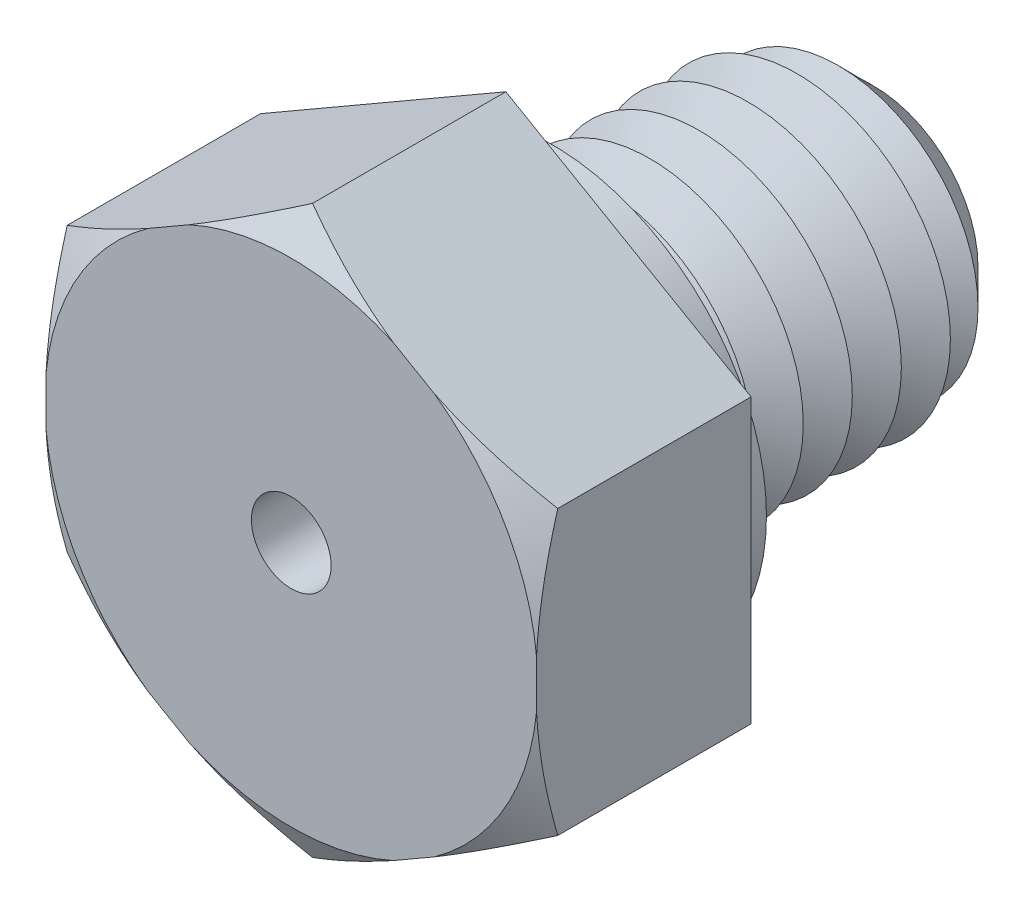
ISO-10303-21;
HEADER;
FILE_DESCRIPTION(('STEP AP214'),'2;1');
FILE_NAME('part.step','',(''),(''),'','','');
FILE_SCHEMA(('AUTOMOTIVE_DESIGN { 1 0 10303 214 1 1 1 1 }'));
ENDSEC;
DATA;
#1=APPLICATION_CONTEXT('core data for automotive mechanical design processes');
#2=APPLICATION_PROTOCOL_DEFINITION('international standard','automotive_design',2000,#1);
#3=PRODUCT_CONTEXT('',#1,'mechanical');
#4=PRODUCT('Part','Part','',(#3));
#5=PRODUCT_RELATED_PRODUCT_CATEGORY('part','',(#4));
#6=PRODUCT_DEFINITION_FORMATION('','',#4);
#7=PRODUCT_DEFINITION_CONTEXT('part definition',#1,'design');
#8=PRODUCT_DEFINITION('design','',#6,#7);
#9=PRODUCT_DEFINITION_SHAPE('','',#8);
#10=(LENGTH_UNIT() NAMED_UNIT(*) SI_UNIT(.MILLI.,.METRE.));
#11=(NAMED_UNIT(*) PLANE_ANGLE_UNIT() SI_UNIT($,.RADIAN.));
#12=(NAMED_UNIT(*) SI_UNIT($,.STERADIAN.) SOLID_ANGLE_UNIT());
#13=UNCERTAINTY_MEASURE_WITH_UNIT(LENGTH_MEASURE(1.E-05),#10,'distance_accuracy_value','');
#14=(GEOMETRIC_REPRESENTATION_CONTEXT(3) GLOBAL_UNCERTAINTY_ASSIGNED_CONTEXT((#13)) GLOBAL_UNIT_ASSIGNED_CONTEXT((#10,
#11,#12)) REPRESENTATION_CONTEXT('',''));
#15=CARTESIAN_POINT('',(0.,0.,0.));
#16=DIRECTION('',(0.,0.,1.));
#17=DIRECTION('',(1.,0.,0.));
#18=AXIS2_PLACEMENT_3D('',#15,#16,#17);
#19=CARTESIAN_POINT('',(4.,2.3094010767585,3.5));
#20=DIRECTION('',(-0.5,-0.866025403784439,0.));
#21=DIRECTION('',(0.866025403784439,-0.5,0.));
#22=AXIS2_PLACEMENT_3D('',#19,#20,#21);
#23=PLANE('',#22);
#24=CARTESIAN_POINT('',(6.77926459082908,0.704791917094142,1.88515125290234));
#25=CARTESIAN_POINT('',(6.65357706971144,0.777357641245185,1.95298106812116));
#26=CARTESIAN_POINT('',(6.52758896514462,0.850096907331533,2.02007962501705));
#27=CARTESIAN_POINT('',(6.2748848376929,0.995995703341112,2.15247084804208));
#28=CARTESIAN_POINT('',(6.14816872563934,1.06915528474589,2.21776328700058));
#29=CARTESIAN_POINT('',(5.8935057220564,1.21618503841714,2.34638757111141));
#30=CARTESIAN_POINT('',(5.76555618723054,1.29005673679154,2.40971246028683));
#31=CARTESIAN_POINT('',(5.50869902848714,1.43835328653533,2.53371033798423));
#32=CARTESIAN_POINT('',(5.37979143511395,1.51277812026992,2.59438341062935));
#33=CARTESIAN_POINT('',(5.11756014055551,1.66417742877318,2.71400439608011));
#34=CARTESIAN_POINT('',(4.98420771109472,1.74116848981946,2.77286873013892));
#35=CARTESIAN_POINT('',(4.7161724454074,1.89591872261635,2.88640197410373));
#36=CARTESIAN_POINT('',(4.58148968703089,1.97367784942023,2.94107112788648));
#37=CARTESIAN_POINT('',(4.31074083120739,2.12999477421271,3.0451841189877));
#38=CARTESIAN_POINT('',(4.17467611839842,2.20855177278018,3.09463271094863));
#39=CARTESIAN_POINT('',(3.90094921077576,2.36658807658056,3.18716064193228));
#40=CARTESIAN_POINT('',(3.76328722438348,2.44606726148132,3.23024080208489));
#41=CARTESIAN_POINT('',(3.43409497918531,2.63612649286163,3.32342391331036));
#42=CARTESIAN_POINT('',(3.24179802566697,2.74714919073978,3.37006382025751));
#43=CARTESIAN_POINT('',(2.95137883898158,2.91482278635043,3.4261412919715));
#44=CARTESIAN_POINT('',(2.85424512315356,2.97090296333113,3.44251989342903));
#45=CARTESIAN_POINT('',(2.65944416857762,3.08337134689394,3.47023794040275));
#46=CARTESIAN_POINT('',(2.56177700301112,3.13975951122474,3.48157806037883));
#47=CARTESIAN_POINT('',(2.36721602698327,3.25208934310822,3.49879538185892));
#48=CARTESIAN_POINT('',(2.27032632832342,3.30802863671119,3.50473421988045));
#49=CARTESIAN_POINT('',(2.07641108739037,3.41998565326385,3.51119583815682));
#50=CARTESIAN_POINT('',(1.97938554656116,3.47600337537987,3.51171867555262));
#51=CARTESIAN_POINT('',(1.78542763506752,3.58798502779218,3.50733170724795));
#52=CARTESIAN_POINT('',(1.68849526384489,3.64394895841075,3.50242193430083));
#53=CARTESIAN_POINT('',(1.49492986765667,3.75570399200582,3.48731840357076));
#54=CARTESIAN_POINT('',(1.39829689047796,3.81149506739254,3.47712384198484));
#55=CARTESIAN_POINT('',(1.17011172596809,3.94323783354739,3.44706969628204));
#56=CARTESIAN_POINT('',(1.03877271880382,4.01906644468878,3.42503535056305));
#57=CARTESIAN_POINT('',(0.777349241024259,4.1699993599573,3.37264454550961));
#58=CARTESIAN_POINT('',(0.647264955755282,4.24510355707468,3.34228687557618));
#59=CARTESIAN_POINT('',(0.388367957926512,4.39457780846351,3.27439527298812));
#60=CARTESIAN_POINT('',(0.259556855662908,4.46894693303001,3.2368532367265));
#61=CARTESIAN_POINT('',(0.00337956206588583,4.61685096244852,3.15577578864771));
#62=CARTESIAN_POINT('',(-0.12398672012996,4.69038591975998,3.11224075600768));
#63=CARTESIAN_POINT('',(-0.378873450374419,4.83754484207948,3.01966290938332));
#64=CARTESIAN_POINT('',(-0.506377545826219,4.91115936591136,2.97056048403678));
#65=CARTESIAN_POINT('',(-0.760034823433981,5.05760846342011,2.86822484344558));
#66=CARTESIAN_POINT('',(-0.886188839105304,5.1304435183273,2.81499436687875));
#67=CARTESIAN_POINT('',(-1.13734672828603,5.27544959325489,2.70513446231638));
#68=CARTESIAN_POINT('',(-1.26235083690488,5.34762074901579,2.6485057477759));
#69=CARTESIAN_POINT('',(-1.51137836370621,5.49139685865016,2.53244390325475));
#70=CARTESIAN_POINT('',(-1.63540176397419,5.56300180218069,2.47301072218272));
#71=CARTESIAN_POINT('',(-1.84520240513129,5.6841302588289,2.37015667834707));
#72=CARTESIAN_POINT('',(-1.93119941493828,5.73378065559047,2.32733101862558));
#73=CARTESIAN_POINT('',(-2.10281451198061,5.83286267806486,2.24068817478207));
#74=CARTESIAN_POINT('',(-2.1884326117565,5.88229431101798,2.19687102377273));
#75=CARTESIAN_POINT('',(-2.35842282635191,5.98043820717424,2.10883190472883));
#76=CARTESIAN_POINT('',(-2.44279852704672,6.02915254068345,2.06461915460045));
#77=CARTESIAN_POINT('',(-2.61124951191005,6.12640776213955,1.97543229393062));
#78=CARTESIAN_POINT('',(-2.69532479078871,6.17494864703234,1.93045817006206));
#79=CARTESIAN_POINT('',(-2.77926459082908,6.22341131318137,1.88515125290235));
#80=B_SPLINE_CURVE_WITH_KNOTS('',3,(#24,#25,#26,#27,#28,#29,#30,#31,#32,#33,#34,#35,#36,#37,#38,
#39,#40,#41,#42,#43,#44,#45,#46,#47,#48,#49,#50,#51,#52,#53,#54,#55,#56,#57,#58,#59,#60,#61,#62,
#63,#64,#65,#66,#67,#68,#69,#70,#71,#72,#73,#74,#75,#76,#77,#78,#79),.UNSPECIFIED.,.F.,.F.,(4,2,
2,2,2,2,2,2,2,2,2,2,2,2,2,2,2,2,2,2,2,2,2,2,2,2,2,4),(0.,0.480604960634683,0.961270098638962,
1.44347608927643,1.92566677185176,2.42016676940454,2.91463799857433,3.4086549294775,
3.90260810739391,4.58254272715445,4.92249867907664,5.26240911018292,5.59839013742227,
5.93436761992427,6.27034307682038,6.60636964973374,7.06584039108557,7.52537799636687,
7.98543702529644,8.44546695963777,8.91099531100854,9.37621741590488,9.84134218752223,
10.3064754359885,10.6308960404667,10.9553058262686,11.2762760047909,11.5972518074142),.UNSPECIFIED.);
#81=CARTESIAN_POINT('',(4.,2.3094010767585,3.15358983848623));
#82=VERTEX_POINT('',#81);
#83=CARTESIAN_POINT('',(2.33627081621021,3.26995556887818,3.5));
#84=VERTEX_POINT('',#83);
#85=EDGE_CURVE('E132',#82,#84,#80,.T.);
#86=ORIENTED_EDGE('',*,*,#85,.F.);
#87=DIRECTION('',(0.,0.,-1.));
#88=VECTOR('',#87,1.);
#89=CARTESIAN_POINT('',(4.,2.3094010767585,3.5));
#90=LINE('',#89,#88);
#91=CARTESIAN_POINT('',(4.,2.3094010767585,0.));
#92=VERTEX_POINT('',#91);
#93=EDGE_CURVE('E144',#82,#92,#90,.T.);
#94=ORIENTED_EDGE('',*,*,#93,.T.);
#95=DIRECTION('',(-0.866025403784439,0.5,0.));
#96=VECTOR('',#95,1.);
#97=CARTESIAN_POINT('',(4.,2.3094010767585,0.));
#98=LINE('',#97,#96);
#99=CARTESIAN_POINT('',(0.,4.61880215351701,0.));
#100=VERTEX_POINT('',#99);
#101=EDGE_CURVE('E248',#92,#100,#98,.T.);
#102=ORIENTED_EDGE('',*,*,#101,.T.);
#103=DIRECTION('',(0.,0.,-1.));
#104=VECTOR('',#103,1.);
#105=CARTESIAN_POINT('',(0.,4.61880215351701,3.5));
#106=LINE('',#105,#104);
#107=CARTESIAN_POINT('',(0.,4.61880215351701,3.15358983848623));
#108=VERTEX_POINT('',#107);
#109=EDGE_CURVE('E178',#108,#100,#106,.T.);
#110=ORIENTED_EDGE('',*,*,#109,.F.);
#111=CARTESIAN_POINT('',(1.66372918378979,3.65824766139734,3.5));
#112=VERTEX_POINT('',#111);
#113=EDGE_CURVE('E151',#112,#108,#80,.T.);
#114=ORIENTED_EDGE('',*,*,#113,.F.);
#115=DIRECTION('',(-0.866025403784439,0.5,0.));
#116=VECTOR('',#115,1.);
#117=CARTESIAN_POINT('',(4.,2.3094010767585,3.5));
#118=LINE('',#117,#116);
#119=EDGE_CURVE('E148',#84,#112,#118,.T.);
#120=ORIENTED_EDGE('',*,*,#119,.F.);
#121=EDGE_LOOP('',(#86,#94,#102,#110,#114,#120));
#122=FACE_BOUND('',#121,.T.);
#123=ADVANCED_FACE('F39',(#122),#23,.F.);
#124=CARTESIAN_POINT('',(0.,4.61880215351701,3.5));
#125=DIRECTION('',(0.5,-0.866025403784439,0.));
#126=DIRECTION('',(0.866025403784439,0.5,0.));
#127=AXIS2_PLACEMENT_3D('',#124,#125,#126);
#128=PLANE('',#127);
#129=CARTESIAN_POINT('',(2.77926459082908,6.22341131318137,1.88515125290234));
#130=CARTESIAN_POINT('',(2.65357706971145,6.15084558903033,1.95298106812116));
#131=CARTESIAN_POINT('',(2.52758896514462,6.07810632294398,2.02007962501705));
#132=CARTESIAN_POINT('',(2.2748848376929,5.9322075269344,2.15247084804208));
#133=CARTESIAN_POINT('',(2.14816872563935,5.85904794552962,2.21776328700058));
#134=CARTESIAN_POINT('',(1.89350572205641,5.71201819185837,2.34638757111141));
#135=CARTESIAN_POINT('',(1.76555618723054,5.63814649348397,2.40971246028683));
#136=CARTESIAN_POINT('',(1.50869902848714,5.48984994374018,2.53371033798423));
#137=CARTESIAN_POINT('',(1.37979143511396,5.41542511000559,2.59438341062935));
#138=CARTESIAN_POINT('',(1.11756014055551,5.26402580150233,2.71400439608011));
#139=CARTESIAN_POINT('',(0.984207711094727,5.18703474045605,2.77286873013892));
#140=CARTESIAN_POINT('',(0.716172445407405,5.03228450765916,2.88640197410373));
#141=CARTESIAN_POINT('',(0.581489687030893,4.95452538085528,2.94107112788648));
#142=CARTESIAN_POINT('',(0.310740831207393,4.7982084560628,3.0451841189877));
#143=CARTESIAN_POINT('',(0.174676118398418,4.71965145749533,3.09463271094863));
#144=CARTESIAN_POINT('',(-0.0990507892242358,4.56161515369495,3.18716064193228));
#145=CARTESIAN_POINT('',(-0.236712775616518,4.48213596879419,3.23024080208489));
#146=CARTESIAN_POINT('',(-0.565905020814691,4.29207673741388,3.32342391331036));
#147=CARTESIAN_POINT('',(-0.758201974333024,4.18105403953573,3.37006382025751));
#148=CARTESIAN_POINT('',(-1.04862116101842,4.01338044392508,3.4261412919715));
#149=CARTESIAN_POINT('',(-1.14575487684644,3.95730026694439,3.44251989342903));
#150=CARTESIAN_POINT('',(-1.34055583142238,3.84483188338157,3.47023794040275));
#151=CARTESIAN_POINT('',(-1.43822299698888,3.78844371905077,3.48157806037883));
#152=CARTESIAN_POINT('',(-1.63278397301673,3.67611388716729,3.49879538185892));
#153=CARTESIAN_POINT('',(-1.72967367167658,3.62017459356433,3.50473421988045));
#154=CARTESIAN_POINT('',(-1.92358891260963,3.50821757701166,3.51119583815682));
#155=CARTESIAN_POINT('',(-2.02061445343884,3.45219985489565,3.51171867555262));
#156=CARTESIAN_POINT('',(-2.21457236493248,3.34021820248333,3.50733170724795));
#157=CARTESIAN_POINT('',(-2.31150473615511,3.28425427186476,3.50242193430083));
#158=CARTESIAN_POINT('',(-2.50507013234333,3.17249923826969,3.48731840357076));
#159=CARTESIAN_POINT('',(-2.60170310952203,3.11670816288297,3.47712384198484));
#160=CARTESIAN_POINT('',(-2.8298882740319,2.98496539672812,3.44706969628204));
#161=CARTESIAN_POINT('',(-2.96122728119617,2.90913678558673,3.42503535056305));
#162=CARTESIAN_POINT('',(-3.22265075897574,2.75820387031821,3.37264454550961));
#163=CARTESIAN_POINT('',(-3.35273504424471,2.68309967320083,3.34228687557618));
#164=CARTESIAN_POINT('',(-3.61163204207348,2.533625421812,3.27439527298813));
#165=CARTESIAN_POINT('',(-3.74044314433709,2.4592562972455,3.2368532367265));
#166=CARTESIAN_POINT('',(-3.99662043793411,2.31135226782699,3.15577578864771));
#167=CARTESIAN_POINT('',(-4.12398672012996,2.23781731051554,3.11224075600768));
#168=CARTESIAN_POINT('',(-4.37887345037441,2.09065838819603,3.01966290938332));
#169=CARTESIAN_POINT('',(-4.50637754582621,2.01704386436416,2.97056048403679));
#170=CARTESIAN_POINT('',(-4.76003482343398,1.87059476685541,2.86822484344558));
#171=CARTESIAN_POINT('',(-4.8861888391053,1.79775971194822,2.81499436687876));
#172=CARTESIAN_POINT('',(-5.13734672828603,1.65275363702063,2.70513446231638));
#173=CARTESIAN_POINT('',(-5.26235083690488,1.58058248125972,2.6485057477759));
#174=CARTESIAN_POINT('',(-5.51137836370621,1.43680637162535,2.53244390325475));
#175=CARTESIAN_POINT('',(-5.63540176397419,1.36520142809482,2.47301072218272));
#176=CARTESIAN_POINT('',(-5.84520240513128,1.24407297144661,2.37015667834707));
#177=CARTESIAN_POINT('',(-5.93119941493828,1.19442257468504,2.32733101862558));
#178=CARTESIAN_POINT('',(-6.10281451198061,1.09534055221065,2.24068817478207));
#179=CARTESIAN_POINT('',(-6.1884326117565,1.04590891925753,2.19687102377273));
#180=CARTESIAN_POINT('',(-6.35842282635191,0.947765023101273,2.10883190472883));
#181=CARTESIAN_POINT('',(-6.44279852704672,0.899050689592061,2.06461915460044));
#182=CARTESIAN_POINT('',(-6.61124951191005,0.80179546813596,1.97543229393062));
#183=CARTESIAN_POINT('',(-6.69532479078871,0.753254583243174,1.93045817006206));
#184=CARTESIAN_POINT('',(-6.77926459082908,0.70479191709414,1.88515125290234));
#185=B_SPLINE_CURVE_WITH_KNOTS('',3,(#129,#130,#131,#132,#133,#134,#135,#136,#137,#138,#139,
#140,#141,#142,#143,#144,#145,#146,#147,#148,#149,#150,#151,#152,#153,#154,#155,#156,#157,#158,
#159,#160,#161,#162,#163,#164,#165,#166,#167,#168,#169,#170,#171,#172,#173,#174,#175,#176,#177,
#178,#179,#180,#181,#182,#183,#184),.UNSPECIFIED.,.F.,.F.,(4,2,2,2,2,2,2,2,2,2,2,2,2,2,2,2,2,2,
2,2,2,2,2,2,2,2,2,4),(0.,0.480604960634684,0.961270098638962,1.44347608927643,1.92566677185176,
2.42016676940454,2.91463799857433,3.4086549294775,3.90260810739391,4.58254272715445,
4.92249867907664,5.26240911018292,5.59839013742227,5.93436761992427,6.27034307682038,
6.60636964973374,7.06584039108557,7.52537799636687,7.98543702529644,8.44546695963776,
8.91099531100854,9.37621741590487,9.84134218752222,10.3064754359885,10.6308960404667,
10.9553058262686,11.2762760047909,11.5972518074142),.UNSPECIFIED.);
#186=CARTESIAN_POINT('',(-1.66372918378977,3.65824766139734,3.5));
#187=VERTEX_POINT('',#186);
#188=EDGE_CURVE('E289',#108,#187,#185,.T.);
#189=ORIENTED_EDGE('',*,*,#188,.F.);
#190=ORIENTED_EDGE('',*,*,#109,.T.);
#191=DIRECTION('',(-0.866025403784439,-0.5,0.));
#192=VECTOR('',#191,1.);
#193=CARTESIAN_POINT('',(0.,4.61880215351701,0.));
#194=LINE('',#193,#192);
#195=CARTESIAN_POINT('',(-4.,2.3094010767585,0.));
#196=VERTEX_POINT('',#195);
#197=EDGE_CURVE('E268',#100,#196,#194,.T.);
#198=ORIENTED_EDGE('',*,*,#197,.T.);
#199=DIRECTION('',(0.,0.,-1.));
#200=VECTOR('',#199,1.);
#201=CARTESIAN_POINT('',(-4.,2.3094010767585,3.5));
#202=LINE('',#201,#200);
#203=CARTESIAN_POINT('',(-4.,2.3094010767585,3.15358983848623));
#204=VERTEX_POINT('',#203);
#205=EDGE_CURVE('E175',#204,#196,#202,.T.);
#206=ORIENTED_EDGE('',*,*,#205,.F.);
#207=CARTESIAN_POINT('',(-2.33627081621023,3.26995556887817,3.5));
#208=VERTEX_POINT('',#207);
#209=EDGE_CURVE('E291',#208,#204,#185,.T.);
#210=ORIENTED_EDGE('',*,*,#209,.F.);
#211=DIRECTION('',(-0.866025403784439,-0.5,0.));
#212=VECTOR('',#211,1.);
#213=CARTESIAN_POINT('',(0.,4.61880215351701,3.5));
#214=LINE('',#213,#212);
#215=EDGE_CURVE('E251',#187,#208,#214,.T.);
#216=ORIENTED_EDGE('',*,*,#215,.F.);
#217=EDGE_LOOP('',(#189,#190,#198,#206,#210,#216));
#218=FACE_BOUND('',#217,.T.);
#219=ADVANCED_FACE('F359',(#218),#128,.F.);
#220=CARTESIAN_POINT('',(-4.,2.3094010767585,3.5));
#221=DIRECTION('',(1.,0.,0.));
#222=DIRECTION('',(0.,0.,-1.));
#223=AXIS2_PLACEMENT_3D('',#220,#221,#222);
#224=PLANE('',#223);
#225=CARTESIAN_POINT('',(-4.,5.08866566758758,2.08330060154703));
#226=CARTESIAN_POINT('',(-4.,4.94414615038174,2.14888120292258));
#227=CARTESIAN_POINT('',(-4.,4.79923170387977,2.21360759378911));
#228=CARTESIAN_POINT('',(-4.,4.5084433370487,2.34093771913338));
#229=CARTESIAN_POINT('',(-4.,4.36256924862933,2.4035410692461));
#230=CARTESIAN_POINT('',(-4.,4.06913305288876,2.52644280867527));
#231=CARTESIAN_POINT('',(-4.,3.92156644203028,2.58673049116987));
#232=CARTESIAN_POINT('',(-4.,3.62518774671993,2.70415001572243));
#233=CARTESIAN_POINT('',(-4.,3.47637571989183,2.76128200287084));
#234=CARTESIAN_POINT('',(-4.,3.17798204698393,2.87144502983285));
#235=CARTESIAN_POINT('',(-4.,3.02840679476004,2.92449322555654));
#236=CARTESIAN_POINT('',(-4.,2.72767549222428,3.02589725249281));
#237=CARTESIAN_POINT('',(-4.,2.57651933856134,3.07425277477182));
#238=CARTESIAN_POINT('',(-4.,2.12084922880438,3.21062944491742));
#239=CARTESIAN_POINT('',(-4.,1.81364350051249,3.29014850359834));
#240=CARTESIAN_POINT('',(-4.,1.28033133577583,3.39840613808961));
#241=CARTESIAN_POINT('',(-4.,1.05588972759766,3.43514774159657));
#242=CARTESIAN_POINT('',(-4.,0.717455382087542,3.47487260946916));
#243=CARTESIAN_POINT('',(-4.,0.604348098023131,3.48554965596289));
#244=CARTESIAN_POINT('',(-4.,0.377758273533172,3.50148677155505));
#245=CARTESIAN_POINT('',(-4.,0.264275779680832,3.50674748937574));
#246=CARTESIAN_POINT('',(-4.,0.0372413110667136,3.51168400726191));
#247=CARTESIAN_POINT('',(-4.,-0.0763106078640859,3.51136237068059));
#248=CARTESIAN_POINT('',(-4.,-0.303259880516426,3.50515259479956));
#249=CARTESIAN_POINT('',(-4.,-0.416657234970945,3.49926448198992));
#250=CARTESIAN_POINT('',(-4.,-0.643045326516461,3.48210091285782));
#251=CARTESIAN_POINT('',(-4.,-0.756036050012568,3.47082527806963));
#252=CARTESIAN_POINT('',(-4.,-0.9814050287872,3.44321260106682));
#253=CARTESIAN_POINT('',(-4.,-1.09378317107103,3.42687465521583));
#254=CARTESIAN_POINT('',(-4.,-1.54188975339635,3.35219605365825));
#255=CARTESIAN_POINT('',(-4.,-1.87460189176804,3.27522286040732));
#256=CARTESIAN_POINT('',(-4.,-2.36751874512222,3.1379521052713));
#257=CARTESIAN_POINT('',(-4.,-2.53101356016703,3.08847923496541));
#258=CARTESIAN_POINT('',(-4.,-2.85611626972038,2.98363580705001));
#259=CARTESIAN_POINT('',(-4.,-3.01772429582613,2.92826566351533));
#260=CARTESIAN_POINT('',(-4.,-3.34106601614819,2.81212836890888));
#261=CARTESIAN_POINT('',(-4.,-3.50277978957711,2.75130648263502));
#262=CARTESIAN_POINT('',(-4.,-3.82469686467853,2.62576992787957));
#263=CARTESIAN_POINT('',(-4.,-3.98490007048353,2.56105501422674));
#264=CARTESIAN_POINT('',(-4.,-4.30300593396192,2.42890950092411));
#265=CARTESIAN_POINT('',(-4.,-4.46091670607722,2.36149833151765));
#266=CARTESIAN_POINT('',(-4.,-4.7755935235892,2.22415533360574));
#267=CARTESIAN_POINT('',(-4.,-4.93235984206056,2.15422413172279));
#268=CARTESIAN_POINT('',(-4.,-5.08866566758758,2.08330060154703));
#269=B_SPLINE_CURVE_WITH_KNOTS('',3,(#225,#226,#227,#228,#229,#230,#231,#232,#233,#234,#235,
#236,#237,#238,#239,#240,#241,#242,#243,#244,#245,#246,#247,#248,#249,#250,#251,#252,#253,#254,
#255,#256,#257,#258,#259,#260,#261,#262,#263,#264,#265,#266,#267,#268),.UNSPECIFIED.,.F.,.F.,(4,
2,2,2,2,2,2,2,2,2,2,2,2,2,2,2,2,2,2,2,2,4),(0.,0.476116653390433,0.952319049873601,
1.43050831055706,1.90867556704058,2.38470991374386,2.8607755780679,3.81133518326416,
4.4927622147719,4.83347879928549,5.17415457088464,5.51467391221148,5.85519163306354,
6.19572063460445,6.53631045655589,7.55838749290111,8.07079781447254,8.58317218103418,
9.1014378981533,9.61973628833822,10.1348057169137,10.6497479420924),.UNSPECIFIED.);
#270=CARTESIAN_POINT('',(-4.,0.388292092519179,3.5));
#271=VERTEX_POINT('',#270);
#272=EDGE_CURVE('E349',#204,#271,#269,.T.);
#273=ORIENTED_EDGE('',*,*,#272,.F.);
#274=ORIENTED_EDGE('',*,*,#205,.T.);
#275=DIRECTION('',(0.,-1.,0.));
#276=VECTOR('',#275,1.);
#277=CARTESIAN_POINT('',(-4.,2.3094010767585,0.));
#278=LINE('',#277,#276);
#279=CARTESIAN_POINT('',(-4.,-2.3094010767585,0.));
#280=VERTEX_POINT('',#279);
#281=EDGE_CURVE('E272',#196,#280,#278,.T.);
#282=ORIENTED_EDGE('',*,*,#281,.T.);
#283=DIRECTION('',(0.,0.,-1.));
#284=VECTOR('',#283,1.);
#285=CARTESIAN_POINT('',(-4.,-2.3094010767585,3.5));
#286=LINE('',#285,#284);
#287=CARTESIAN_POINT('',(-4.,-2.3094010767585,3.15358983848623));
#288=VERTEX_POINT('',#287);
#289=EDGE_CURVE('E172',#288,#280,#286,.T.);
#290=ORIENTED_EDGE('',*,*,#289,.F.);
#291=CARTESIAN_POINT('',(-4.,-0.38829209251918,3.5));
#292=VERTEX_POINT('',#291);
#293=EDGE_CURVE('E343',#292,#288,#269,.T.);
#294=ORIENTED_EDGE('',*,*,#293,.F.);
#295=DIRECTION('',(0.,-1.,0.));
#296=VECTOR('',#295,1.);
#297=CARTESIAN_POINT('',(-4.,2.3094010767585,3.5));
#298=LINE('',#297,#296);
#299=EDGE_CURVE('E255',#271,#292,#298,.T.);
#300=ORIENTED_EDGE('',*,*,#299,.F.);
#301=EDGE_LOOP('',(#273,#274,#282,#290,#294,#300));
#302=FACE_BOUND('',#301,.T.);
#303=ADVANCED_FACE('F355',(#302),#224,.F.);
#304=CARTESIAN_POINT('',(-4.,-2.3094010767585,3.5));
#305=DIRECTION('',(0.5,0.866025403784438,0.));
#306=DIRECTION('',(-0.866025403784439,0.5,0.));
#307=AXIS2_PLACEMENT_3D('',#304,#305,#306);
#308=PLANE('',#307);
#309=CARTESIAN_POINT('',(-6.77926459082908,-0.704791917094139,1.88515125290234));
#310=CARTESIAN_POINT('',(-6.65357706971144,-0.777357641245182,1.95298106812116));
#311=CARTESIAN_POINT('',(-6.52758896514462,-0.85009690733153,2.02007962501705));
#312=CARTESIAN_POINT('',(-6.2748848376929,-0.995995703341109,2.15247084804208));
#313=CARTESIAN_POINT('',(-6.14816872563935,-1.06915528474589,2.21776328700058));
#314=CARTESIAN_POINT('',(-5.89350572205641,-1.21618503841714,2.34638757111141));
#315=CARTESIAN_POINT('',(-5.76555618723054,-1.29005673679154,2.40971246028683));
#316=CARTESIAN_POINT('',(-5.50869902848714,-1.43835328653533,2.53371033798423));
#317=CARTESIAN_POINT('',(-5.37979143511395,-1.51277812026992,2.59438341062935));
#318=CARTESIAN_POINT('',(-5.11756014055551,-1.66417742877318,2.71400439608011));
#319=CARTESIAN_POINT('',(-4.98420771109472,-1.74116848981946,2.77286873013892));
#320=CARTESIAN_POINT('',(-4.7161724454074,-1.89591872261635,2.88640197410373));
#321=CARTESIAN_POINT('',(-4.58148968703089,-1.97367784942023,2.94107112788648));
#322=CARTESIAN_POINT('',(-4.31074083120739,-2.12999477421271,3.0451841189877));
#323=CARTESIAN_POINT('',(-4.17467611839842,-2.20855177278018,3.09463271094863));
#324=CARTESIAN_POINT('',(-3.90094921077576,-2.36658807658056,3.18716064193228));
#325=CARTESIAN_POINT('',(-3.76328722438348,-2.44606726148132,3.23024080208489));
#326=CARTESIAN_POINT('',(-3.43409497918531,-2.63612649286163,3.32342391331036));
#327=CARTESIAN_POINT('',(-3.24179802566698,-2.74714919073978,3.37006382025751));
#328=CARTESIAN_POINT('',(-2.95137883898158,-2.91482278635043,3.4261412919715));
#329=CARTESIAN_POINT('',(-2.85424512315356,-2.97090296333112,3.44251989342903));
#330=CARTESIAN_POINT('',(-2.65944416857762,-3.08337134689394,3.47023794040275));
#331=CARTESIAN_POINT('',(-2.56177700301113,-3.13975951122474,3.48157806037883));
#332=CARTESIAN_POINT('',(-2.36721602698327,-3.25208934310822,3.49879538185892));
#333=CARTESIAN_POINT('',(-2.27032632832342,-3.30802863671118,3.50473421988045));
#334=CARTESIAN_POINT('',(-2.07641108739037,-3.41998565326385,3.51119583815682));
#335=CARTESIAN_POINT('',(-1.97938554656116,-3.47600337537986,3.51171867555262));
#336=CARTESIAN_POINT('',(-1.78542763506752,-3.58798502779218,3.50733170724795));
#337=CARTESIAN_POINT('',(-1.68849526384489,-3.64394895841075,3.50242193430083));
#338=CARTESIAN_POINT('',(-1.49492986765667,-3.75570399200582,3.48731840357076));
#339=CARTESIAN_POINT('',(-1.39829689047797,-3.81149506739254,3.47712384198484));
#340=CARTESIAN_POINT('',(-1.1701117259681,-3.94323783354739,3.44706969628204));
#341=CARTESIAN_POINT('',(-1.03877271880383,-4.01906644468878,3.42503535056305));
#342=CARTESIAN_POINT('',(-0.777349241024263,-4.1699993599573,3.37264454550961));
#343=CARTESIAN_POINT('',(-0.647264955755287,-4.24510355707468,3.34228687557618));
#344=CARTESIAN_POINT('',(-0.388367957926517,-4.39457780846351,3.27439527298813));
#345=CARTESIAN_POINT('',(-0.259556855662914,-4.46894693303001,3.2368532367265));
#346=CARTESIAN_POINT('',(-0.00337956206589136,-4.61685096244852,3.15577578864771));
#347=CARTESIAN_POINT('',(0.123986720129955,-4.69038591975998,3.11224075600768));
#348=CARTESIAN_POINT('',(0.378873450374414,-4.83754484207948,3.01966290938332));
#349=CARTESIAN_POINT('',(0.506377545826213,-4.91115936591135,2.97056048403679));
#350=CARTESIAN_POINT('',(0.760034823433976,-5.0576084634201,2.86822484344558));
#351=CARTESIAN_POINT('',(0.886188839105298,-5.13044351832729,2.81499436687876));
#352=CARTESIAN_POINT('',(1.13734672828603,-5.27544959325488,2.70513446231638));
#353=CARTESIAN_POINT('',(1.26235083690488,-5.34762074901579,2.6485057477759));
#354=CARTESIAN_POINT('',(1.51137836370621,-5.49139685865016,2.53244390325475));
#355=CARTESIAN_POINT('',(1.63540176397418,-5.56300180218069,2.47301072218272));
#356=CARTESIAN_POINT('',(1.84520240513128,-5.6841302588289,2.37015667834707));
#357=CARTESIAN_POINT('',(1.93119941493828,-5.73378065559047,2.32733101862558));
#358=CARTESIAN_POINT('',(2.10281451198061,-5.83286267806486,2.24068817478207));
#359=CARTESIAN_POINT('',(2.1884326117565,-5.88229431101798,2.19687102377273));
#360=CARTESIAN_POINT('',(2.35842282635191,-5.98043820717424,2.10883190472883));
#361=CARTESIAN_POINT('',(2.44279852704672,-6.02915254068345,2.06461915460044));
#362=CARTESIAN_POINT('',(2.61124951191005,-6.12640776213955,1.97543229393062));
#363=CARTESIAN_POINT('',(2.6953247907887,-6.17494864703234,1.93045817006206));
#364=CARTESIAN_POINT('',(2.77926459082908,-6.22341131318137,1.88515125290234));
#365=B_SPLINE_CURVE_WITH_KNOTS('',3,(#309,#310,#311,#312,#313,#314,#315,#316,#317,#318,#319,
#320,#321,#322,#323,#324,#325,#326,#327,#328,#329,#330,#331,#332,#333,#334,#335,#336,#337,#338,
#339,#340,#341,#342,#343,#344,#345,#346,#347,#348,#349,#350,#351,#352,#353,#354,#355,#356,#357,
#358,#359,#360,#361,#362,#363,#364),.UNSPECIFIED.,.F.,.F.,(4,2,2,2,2,2,2,2,2,2,2,2,2,2,2,2,2,2,
2,2,2,2,2,2,2,2,2,4),(0.,0.480604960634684,0.961270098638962,1.44347608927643,1.92566677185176,
2.42016676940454,2.91463799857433,3.4086549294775,3.90260810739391,4.58254272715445,
4.92249867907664,5.26240911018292,5.59839013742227,5.93436761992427,6.27034307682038,
6.60636964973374,7.06584039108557,7.52537799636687,7.98543702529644,8.44546695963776,
8.91099531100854,9.37621741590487,9.84134218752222,10.3064754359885,10.6308960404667,
10.9553058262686,11.2762760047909,11.5972518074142),.UNSPECIFIED.);
#366=CARTESIAN_POINT('',(-2.33627081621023,-3.26995556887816,3.5));
#367=VERTEX_POINT('',#366);
#368=EDGE_CURVE('E350',#288,#367,#365,.T.);
#369=ORIENTED_EDGE('',*,*,#368,.F.);
#370=ORIENTED_EDGE('',*,*,#289,.T.);
#371=DIRECTION('',(0.866025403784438,-0.5,0.));
#372=VECTOR('',#371,1.);
#373=CARTESIAN_POINT('',(-4.,-2.3094010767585,0.));
#374=LINE('',#373,#372);
#375=CARTESIAN_POINT('',(0.,-4.61880215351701,0.));
#376=VERTEX_POINT('',#375);
#377=EDGE_CURVE('E276',#280,#376,#374,.T.);
#378=ORIENTED_EDGE('',*,*,#377,.T.);
#379=DIRECTION('',(0.,0.,-1.));
#380=VECTOR('',#379,1.);
#381=CARTESIAN_POINT('',(0.,-4.61880215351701,3.5));
#382=LINE('',#381,#380);
#383=CARTESIAN_POINT('',(0.,-4.61880215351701,3.15358983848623));
#384=VERTEX_POINT('',#383);
#385=EDGE_CURVE('E163',#384,#376,#382,.T.);
#386=ORIENTED_EDGE('',*,*,#385,.F.);
#387=CARTESIAN_POINT('',(-1.66372918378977,-3.65824766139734,3.5));
#388=VERTEX_POINT('',#387);
#389=EDGE_CURVE('E337',#388,#384,#365,.T.);
#390=ORIENTED_EDGE('',*,*,#389,.F.);
#391=DIRECTION('',(0.866025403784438,-0.5,0.));
#392=VECTOR('',#391,1.);
#393=CARTESIAN_POINT('',(-4.,-2.3094010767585,3.5));
#394=LINE('',#393,#392);
#395=EDGE_CURVE('E259',#367,#388,#394,.T.);
#396=ORIENTED_EDGE('',*,*,#395,.F.);
#397=EDGE_LOOP('',(#369,#370,#378,#386,#390,#396));
#398=FACE_BOUND('',#397,.T.);
#399=ADVANCED_FACE('F358',(#398),#308,.F.);
#400=CARTESIAN_POINT('',(0.,-4.61880215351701,3.5));
#401=DIRECTION('',(-0.5,0.866025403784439,0.));
#402=DIRECTION('',(-0.866025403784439,-0.5,0.));
#403=AXIS2_PLACEMENT_3D('',#400,#401,#402);
#404=PLANE('',#403);
#405=CARTESIAN_POINT('',(-2.77926459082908,-6.22341131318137,1.88515125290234));
#406=CARTESIAN_POINT('',(-2.65357706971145,-6.15084558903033,1.95298106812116));
#407=CARTESIAN_POINT('',(-2.52758896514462,-6.07810632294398,2.02007962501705));
#408=CARTESIAN_POINT('',(-2.2748848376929,-5.9322075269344,2.15247084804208));
#409=CARTESIAN_POINT('',(-2.14816872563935,-5.85904794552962,2.21776328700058));
#410=CARTESIAN_POINT('',(-1.89350572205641,-5.71201819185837,2.34638757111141));
#411=CARTESIAN_POINT('',(-1.76555618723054,-5.63814649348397,2.40971246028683));
#412=CARTESIAN_POINT('',(-1.50869902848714,-5.48984994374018,2.53371033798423));
#413=CARTESIAN_POINT('',(-1.37979143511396,-5.41542511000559,2.59438341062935));
#414=CARTESIAN_POINT('',(-1.11756014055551,-5.26402580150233,2.71400439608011));
#415=CARTESIAN_POINT('',(-0.984207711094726,-5.18703474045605,2.77286873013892));
#416=CARTESIAN_POINT('',(-0.716172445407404,-5.03228450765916,2.88640197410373));
#417=CARTESIAN_POINT('',(-0.581489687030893,-4.95452538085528,2.94107112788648));
#418=CARTESIAN_POINT('',(-0.310740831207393,-4.7982084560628,3.0451841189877));
#419=CARTESIAN_POINT('',(-0.174676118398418,-4.71965145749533,3.09463271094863));
#420=CARTESIAN_POINT('',(0.0990507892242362,-4.56161515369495,3.18716064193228));
#421=CARTESIAN_POINT('',(0.236712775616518,-4.48213596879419,3.23024080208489));
#422=CARTESIAN_POINT('',(0.565905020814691,-4.29207673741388,3.32342391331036));
#423=CARTESIAN_POINT('',(0.758201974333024,-4.18105403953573,3.37006382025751));
#424=CARTESIAN_POINT('',(1.04862116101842,-4.01338044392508,3.4261412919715));
#425=CARTESIAN_POINT('',(1.14575487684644,-3.95730026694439,3.44251989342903));
#426=CARTESIAN_POINT('',(1.34055583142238,-3.84483188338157,3.47023794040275));
#427=CARTESIAN_POINT('',(1.43822299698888,-3.78844371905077,3.48157806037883));
#428=CARTESIAN_POINT('',(1.63278397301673,-3.67611388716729,3.49879538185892));
#429=CARTESIAN_POINT('',(1.72967367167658,-3.62017459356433,3.50473421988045));
#430=CARTESIAN_POINT('',(1.92358891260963,-3.50821757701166,3.51119583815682));
#431=CARTESIAN_POINT('',(2.02061445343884,-3.45219985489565,3.51171867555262));
#432=CARTESIAN_POINT('',(2.21457236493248,-3.34021820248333,3.50733170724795));
#433=CARTESIAN_POINT('',(2.31150473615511,-3.28425427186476,3.50242193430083));
#434=CARTESIAN_POINT('',(2.50507013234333,-3.17249923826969,3.48731840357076));
#435=CARTESIAN_POINT('',(2.60170310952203,-3.11670816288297,3.47712384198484));
#436=CARTESIAN_POINT('',(2.8298882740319,-2.98496539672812,3.44706969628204));
#437=CARTESIAN_POINT('',(2.96122728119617,-2.90913678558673,3.42503535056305));
#438=CARTESIAN_POINT('',(3.22265075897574,-2.75820387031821,3.37264454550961));
#439=CARTESIAN_POINT('',(3.35273504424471,-2.68309967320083,3.34228687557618));
#440=CARTESIAN_POINT('',(3.61163204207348,-2.533625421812,3.27439527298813));
#441=CARTESIAN_POINT('',(3.74044314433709,-2.4592562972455,3.2368532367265));
#442=CARTESIAN_POINT('',(3.99662043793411,-2.31135226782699,3.15577578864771));
#443=CARTESIAN_POINT('',(4.12398672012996,-2.23781731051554,3.11224075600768));
#444=CARTESIAN_POINT('',(4.37887345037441,-2.09065838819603,3.01966290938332));
#445=CARTESIAN_POINT('',(4.50637754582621,-2.01704386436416,2.97056048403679));
#446=CARTESIAN_POINT('',(4.76003482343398,-1.87059476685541,2.86822484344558));
#447=CARTESIAN_POINT('',(4.8861888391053,-1.79775971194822,2.81499436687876));
#448=CARTESIAN_POINT('',(5.13734672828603,-1.65275363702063,2.70513446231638));
#449=CARTESIAN_POINT('',(5.26235083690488,-1.58058248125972,2.6485057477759));
#450=CARTESIAN_POINT('',(5.51137836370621,-1.43680637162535,2.53244390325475));
#451=CARTESIAN_POINT('',(5.63540176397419,-1.36520142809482,2.47301072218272));
#452=CARTESIAN_POINT('',(5.84520240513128,-1.24407297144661,2.37015667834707));
#453=CARTESIAN_POINT('',(5.93119941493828,-1.19442257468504,2.32733101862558));
#454=CARTESIAN_POINT('',(6.10281451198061,-1.09534055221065,2.24068817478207));
#455=CARTESIAN_POINT('',(6.1884326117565,-1.04590891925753,2.19687102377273));
#456=CARTESIAN_POINT('',(6.35842282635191,-0.947765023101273,2.10883190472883));
#457=CARTESIAN_POINT('',(6.44279852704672,-0.899050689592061,2.06461915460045));
#458=CARTESIAN_POINT('',(6.61124951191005,-0.80179546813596,1.97543229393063));
#459=CARTESIAN_POINT('',(6.69532479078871,-0.753254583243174,1.93045817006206));
#460=CARTESIAN_POINT('',(6.77926459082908,-0.70479191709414,1.88515125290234));
#461=B_SPLINE_CURVE_WITH_KNOTS('',3,(#405,#406,#407,#408,#409,#410,#411,#412,#413,#414,#415,
#416,#417,#418,#419,#420,#421,#422,#423,#424,#425,#426,#427,#428,#429,#430,#431,#432,#433,#434,
#435,#436,#437,#438,#439,#440,#441,#442,#443,#444,#445,#446,#447,#448,#449,#450,#451,#452,#453,
#454,#455,#456,#457,#458,#459,#460),.UNSPECIFIED.,.F.,.F.,(4,2,2,2,2,2,2,2,2,2,2,2,2,2,2,2,2,2,
2,2,2,2,2,2,2,2,2,4),(0.,0.480604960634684,0.961270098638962,1.44347608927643,1.92566677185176,
2.42016676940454,2.91463799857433,3.4086549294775,3.90260810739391,4.58254272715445,
4.92249867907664,5.26240911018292,5.59839013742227,5.93436761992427,6.27034307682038,
6.60636964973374,7.06584039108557,7.52537799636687,7.98543702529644,8.44546695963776,
8.91099531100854,9.37621741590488,9.84134218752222,10.3064754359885,10.6308960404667,
10.9553058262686,11.2762760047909,11.5972518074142),.UNSPECIFIED.);
#462=CARTESIAN_POINT('',(1.66372918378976,-3.65824766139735,3.5));
#463=VERTEX_POINT('',#462);
#464=EDGE_CURVE('E64',#384,#463,#461,.T.);
#465=ORIENTED_EDGE('',*,*,#464,.F.);
#466=ORIENTED_EDGE('',*,*,#385,.T.);
#467=DIRECTION('',(0.866025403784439,0.5,0.));
#468=VECTOR('',#467,1.);
#469=CARTESIAN_POINT('',(0.,-4.61880215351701,0.));
#470=LINE('',#469,#468);
#471=CARTESIAN_POINT('',(4.,-2.3094010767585,0.));
#472=VERTEX_POINT('',#471);
#473=EDGE_CURVE('E279',#376,#472,#470,.T.);
#474=ORIENTED_EDGE('',*,*,#473,.T.);
#475=DIRECTION('',(0.,0.,-1.));
#476=VECTOR('',#475,1.);
#477=CARTESIAN_POINT('',(4.,-2.3094010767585,3.5));
#478=LINE('',#477,#476);
#479=CARTESIAN_POINT('',(4.,-2.3094010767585,3.15358983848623));
#480=VERTEX_POINT('',#479);
#481=EDGE_CURVE('E157',#480,#472,#478,.T.);
#482=ORIENTED_EDGE('',*,*,#481,.F.);
#483=CARTESIAN_POINT('',(2.33627081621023,-3.26995556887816,3.5));
#484=VERTEX_POINT('',#483);
#485=EDGE_CURVE('E332',#484,#480,#461,.T.);
#486=ORIENTED_EDGE('',*,*,#485,.F.);
#487=DIRECTION('',(0.866025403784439,0.5,0.));
#488=VECTOR('',#487,1.);
#489=CARTESIAN_POINT('',(0.,-4.61880215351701,3.5));
#490=LINE('',#489,#488);
#491=EDGE_CURVE('E166',#463,#484,#490,.T.);
#492=ORIENTED_EDGE('',*,*,#491,.F.);
#493=EDGE_LOOP('',(#465,#466,#474,#482,#486,#492));
#494=FACE_BOUND('',#493,.T.);
#495=ADVANCED_FACE('F380',(#494),#404,.F.);
#496=CARTESIAN_POINT('',(4.,-2.3094010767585,3.5));
#497=DIRECTION('',(-1.,0.,0.));
#498=DIRECTION('',(0.,-1.,0.));
#499=AXIS2_PLACEMENT_3D('',#496,#497,#498);
#500=PLANE('',#499);
#501=CARTESIAN_POINT('',(4.,-5.08866566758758,2.08330060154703));
#502=CARTESIAN_POINT('',(4.,-4.94414615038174,2.14888120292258));
#503=CARTESIAN_POINT('',(4.,-4.79923170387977,2.21360759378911));
#504=CARTESIAN_POINT('',(4.,-4.5084433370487,2.34093771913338));
#505=CARTESIAN_POINT('',(4.,-4.36256924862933,2.4035410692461));
#506=CARTESIAN_POINT('',(4.,-4.06913305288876,2.52644280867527));
#507=CARTESIAN_POINT('',(4.,-3.92156644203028,2.58673049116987));
#508=CARTESIAN_POINT('',(4.,-3.62518774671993,2.70415001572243));
#509=CARTESIAN_POINT('',(4.,-3.47637571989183,2.76128200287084));
#510=CARTESIAN_POINT('',(4.,-3.17798204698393,2.87144502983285));
#511=CARTESIAN_POINT('',(4.,-3.02840679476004,2.92449322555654));
#512=CARTESIAN_POINT('',(4.,-2.72767549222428,3.02589725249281));
#513=CARTESIAN_POINT('',(4.,-2.57651933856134,3.07425277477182));
#514=CARTESIAN_POINT('',(4.,-2.12084922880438,3.21062944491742));
#515=CARTESIAN_POINT('',(4.,-1.81364350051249,3.29014850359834));
#516=CARTESIAN_POINT('',(4.,-1.28033133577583,3.39840613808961));
#517=CARTESIAN_POINT('',(4.,-1.05588972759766,3.43514774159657));
#518=CARTESIAN_POINT('',(4.,-0.717455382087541,3.47487260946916));
#519=CARTESIAN_POINT('',(4.,-0.604348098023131,3.48554965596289));
#520=CARTESIAN_POINT('',(4.,-0.377758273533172,3.50148677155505));
#521=CARTESIAN_POINT('',(4.,-0.264275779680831,3.50674748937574));
#522=CARTESIAN_POINT('',(4.,-0.0372413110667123,3.51168400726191));
#523=CARTESIAN_POINT('',(4.,0.0763106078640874,3.51136237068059));
#524=CARTESIAN_POINT('',(4.,0.303259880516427,3.50515259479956));
#525=CARTESIAN_POINT('',(4.,0.416657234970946,3.49926448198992));
#526=CARTESIAN_POINT('',(4.,0.643045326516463,3.48210091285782));
#527=CARTESIAN_POINT('',(4.,0.756036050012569,3.47082527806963));
#528=CARTESIAN_POINT('',(4.,0.981405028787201,3.44321260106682));
#529=CARTESIAN_POINT('',(4.,1.09378317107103,3.42687465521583));
#530=CARTESIAN_POINT('',(4.,1.54188975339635,3.35219605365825));
#531=CARTESIAN_POINT('',(4.,1.87460189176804,3.27522286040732));
#532=CARTESIAN_POINT('',(4.,2.36751874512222,3.1379521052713));
#533=CARTESIAN_POINT('',(4.,2.53101356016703,3.08847923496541));
#534=CARTESIAN_POINT('',(4.,2.85611626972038,2.98363580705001));
#535=CARTESIAN_POINT('',(4.,3.01772429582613,2.92826566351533));
#536=CARTESIAN_POINT('',(4.,3.34106601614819,2.81212836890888));
#537=CARTESIAN_POINT('',(4.,3.50277978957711,2.75130648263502));
#538=CARTESIAN_POINT('',(4.,3.82469686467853,2.62576992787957));
#539=CARTESIAN_POINT('',(4.,3.98490007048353,2.56105501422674));
#540=CARTESIAN_POINT('',(4.,4.30300593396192,2.42890950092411));
#541=CARTESIAN_POINT('',(4.,4.46091670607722,2.36149833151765));
#542=CARTESIAN_POINT('',(4.,4.7755935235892,2.22415533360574));
#543=CARTESIAN_POINT('',(4.,4.93235984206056,2.15422413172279));
#544=CARTESIAN_POINT('',(4.,5.08866566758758,2.08330060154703));
#545=B_SPLINE_CURVE_WITH_KNOTS('',3,(#501,#502,#503,#504,#505,#506,#507,#508,#509,#510,#511,
#512,#513,#514,#515,#516,#517,#518,#519,#520,#521,#522,#523,#524,#525,#526,#527,#528,#529,#530,
#531,#532,#533,#534,#535,#536,#537,#538,#539,#540,#541,#542,#543,#544),.UNSPECIFIED.,.F.,.F.,(4,
2,2,2,2,2,2,2,2,2,2,2,2,2,2,2,2,2,2,2,2,4),(0.,0.476116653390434,0.952319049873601,
1.43050831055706,1.90867556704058,2.38470991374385,2.8607755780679,3.81133518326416,
4.4927622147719,4.83347879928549,5.17415457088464,5.51467391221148,5.85519163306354,
6.19572063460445,6.53631045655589,7.5583874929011,8.07079781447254,8.58317218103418,
9.1014378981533,9.61973628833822,10.1348057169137,10.6497479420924),.UNSPECIFIED.);
#546=CARTESIAN_POINT('',(4.,-0.38829209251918,3.5));
#547=VERTEX_POINT('',#546);
#548=EDGE_CURVE('E56',#480,#547,#545,.T.);
#549=ORIENTED_EDGE('',*,*,#548,.F.);
#550=ORIENTED_EDGE('',*,*,#481,.T.);
#551=DIRECTION('',(0.,1.,0.));
#552=VECTOR('',#551,1.);
#553=CARTESIAN_POINT('',(4.,-2.3094010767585,0.));
#554=LINE('',#553,#552);
#555=EDGE_CURVE('E154',#472,#92,#554,.T.);
#556=ORIENTED_EDGE('',*,*,#555,.T.);
#557=ORIENTED_EDGE('',*,*,#93,.F.);
#558=CARTESIAN_POINT('',(4.,0.388292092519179,3.5));
#559=VERTEX_POINT('',#558);
#560=EDGE_CURVE('E129',#559,#82,#545,.T.);
#561=ORIENTED_EDGE('',*,*,#560,.F.);
#562=DIRECTION('',(0.,1.,0.));
#563=VECTOR('',#562,1.);
#564=CARTESIAN_POINT('',(4.,-2.3094010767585,3.5));
#565=LINE('',#564,#563);
#566=EDGE_CURVE('E158',#547,#559,#565,.T.);
#567=ORIENTED_EDGE('',*,*,#566,.F.);
#568=EDGE_LOOP('',(#549,#550,#556,#557,#561,#567));
#569=FACE_BOUND('',#568,.T.);
#570=ADVANCED_FACE('F152',(#569),#500,.F.);
#571=CARTESIAN_POINT('',(0.,0.,3.5));
#572=DIRECTION('',(0.,0.,1.));
#573=DIRECTION('',(1.,0.,0.));
#574=AXIS2_PLACEMENT_3D('',#571,#572,#573);
#575=PLANE('',#574);
#576=CARTESIAN_POINT('',(0.,0.,3.5));
#577=DIRECTION('',(0.,0.,1.));
#578=DIRECTION('',(1.,0.,0.));
#579=AXIS2_PLACEMENT_3D('',#576,#577,#578);
#580=CIRCLE('',#579,0.65);
#581=CARTESIAN_POINT('',(0.65,0.,3.5));
#582=VERTEX_POINT('',#581);
#583=EDGE_CURVE('E295',#582,#582,#580,.T.);
#584=ORIENTED_EDGE('',*,*,#583,.F.);
#585=EDGE_LOOP('',(#584));
#586=FACE_BOUND('',#585,.T.);
#587=ORIENTED_EDGE('',*,*,#566,.T.);
#588=CARTESIAN_POINT('',(0.,0.,3.5));
#589=DIRECTION('',(0.,0.,1.));
#590=DIRECTION('',(1.,0.,0.));
#591=AXIS2_PLACEMENT_3D('',#588,#589,#590);
#592=CIRCLE('',#591,4.01880215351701);
#593=EDGE_CURVE('E134',#559,#84,#592,.T.);
#594=ORIENTED_EDGE('',*,*,#593,.T.);
#595=ORIENTED_EDGE('',*,*,#119,.T.);
#596=CARTESIAN_POINT('',(0.,0.,3.5));
#597=DIRECTION('',(0.,0.,1.));
#598=DIRECTION('',(1.,0.,0.));
#599=AXIS2_PLACEMENT_3D('',#596,#597,#598);
#600=CIRCLE('',#599,4.01880215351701);
#601=EDGE_CURVE('E11',#112,#187,#600,.T.);
#602=ORIENTED_EDGE('',*,*,#601,.T.);
#603=ORIENTED_EDGE('',*,*,#215,.T.);
#604=EDGE_CURVE('E49',#208,#271,#600,.T.);
#605=ORIENTED_EDGE('',*,*,#604,.T.);
#606=ORIENTED_EDGE('',*,*,#299,.T.);
#607=EDGE_CURVE('E294',#292,#367,#600,.T.);
#608=ORIENTED_EDGE('',*,*,#607,.T.);
#609=ORIENTED_EDGE('',*,*,#395,.T.);
#610=EDGE_CURVE('E292',#388,#463,#600,.T.);
#611=ORIENTED_EDGE('',*,*,#610,.T.);
#612=ORIENTED_EDGE('',*,*,#491,.T.);
#613=EDGE_CURVE('E43',#484,#547,#600,.T.);
#614=ORIENTED_EDGE('',*,*,#613,.T.);
#615=EDGE_LOOP('',(#587,#594,#595,#602,#603,#605,#606,#608,#609,#611,#612,#614));
#616=FACE_BOUND('',#615,.T.);
#617=ADVANCED_FACE('F390',(#586,#616),#575,.T.);
#618=CARTESIAN_POINT('',(0.,0.,0.));
#619=DIRECTION('',(0.,0.,1.));
#620=DIRECTION('',(1.,0.,0.));
#621=AXIS2_PLACEMENT_3D('',#618,#619,#620);
#622=PLANE('',#621);
#623=CARTESIAN_POINT('',(0.,0.,0.));
#624=DIRECTION('',(0.,0.,1.));
#625=DIRECTION('',(1.,0.,0.));
#626=AXIS2_PLACEMENT_3D('',#623,#624,#625);
#627=CIRCLE('',#626,3.5);
#628=CARTESIAN_POINT('',(3.5,0.,0.));
#629=VERTEX_POINT('',#628);
#630=EDGE_CURVE('E181',#629,#629,#627,.F.);
#631=ORIENTED_EDGE('',*,*,#630,.F.);
#632=EDGE_LOOP('',(#631));
#633=FACE_BOUND('',#632,.T.);
#634=ORIENTED_EDGE('',*,*,#101,.F.);
#635=ORIENTED_EDGE('',*,*,#555,.F.);
#636=ORIENTED_EDGE('',*,*,#473,.F.);
#637=ORIENTED_EDGE('',*,*,#377,.F.);
#638=ORIENTED_EDGE('',*,*,#281,.F.);
#639=ORIENTED_EDGE('',*,*,#197,.F.);
#640=EDGE_LOOP('',(#634,#635,#636,#637,#638,#639));
#641=FACE_BOUND('',#640,.T.);
#642=ADVANCED_FACE('F395',(#633,#641),#622,.F.);
#643=CARTESIAN_POINT('',(0.,0.,-0.75));
#644=DIRECTION('',(0.,0.,1.));
#645=DIRECTION('',(1.,0.,0.));
#646=AXIS2_PLACEMENT_3D('',#643,#644,#645);
#647=CYLINDRICAL_SURFACE('',#646,3.5);
#648=CARTESIAN_POINT('',(0.,0.,-0.75));
#649=DIRECTION('',(0.,0.,-1.));
#650=DIRECTION('',(-1.,0.,0.));
#651=AXIS2_PLACEMENT_3D('',#648,#649,#650);
#652=CIRCLE('',#651,3.5);
#653=CARTESIAN_POINT('',(-3.5,0.,-0.75));
#654=VERTEX_POINT('',#653);
#655=EDGE_CURVE('E244',#654,#654,#652,.T.);
#656=ORIENTED_EDGE('',*,*,#655,.F.);
#657=EDGE_LOOP('',(#656));
#658=FACE_BOUND('',#657,.T.);
#659=ORIENTED_EDGE('',*,*,#630,.T.);
#660=EDGE_LOOP('',(#659));
#661=FACE_BOUND('',#660,.T.);
#662=ADVANCED_FACE('F402',(#658,#661),#647,.T.);
#663=CARTESIAN_POINT('',(0.,0.,-0.75));
#664=DIRECTION('',(0.,0.,-1.));
#665=DIRECTION('',(-1.,0.,0.));
#666=AXIS2_PLACEMENT_3D('',#663,#664,#665);
#667=PLANE('',#666);
#668=CARTESIAN_POINT('',(0.,0.,-0.75));
#669=DIRECTION('',(0.,0.,1.));
#670=DIRECTION('',(1.,0.,0.));
#671=AXIS2_PLACEMENT_3D('',#668,#669,#670);
#672=CIRCLE('',#671,2.5);
#673=CARTESIAN_POINT('',(2.5,0.,-0.75));
#674=VERTEX_POINT('',#673);
#675=EDGE_CURVE('E240',#674,#674,#672,.T.);
#676=ORIENTED_EDGE('',*,*,#675,.T.);
#677=EDGE_LOOP('',(#676));
#678=FACE_BOUND('',#677,.T.);
#679=ORIENTED_EDGE('',*,*,#655,.T.);
#680=EDGE_LOOP('',(#679));
#681=FACE_BOUND('',#680,.T.);
#682=ADVANCED_FACE('F408',(#678,#681),#667,.T.);
#683=CARTESIAN_POINT('',(0.,0.,-0.75));
#684=DIRECTION('',(0.,0.,1.));
#685=DIRECTION('',(1.,0.,0.));
#686=AXIS2_PLACEMENT_3D('',#683,#684,#685);
#687=CONICAL_SURFACE('',#686,2.5,1.0471975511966);
#688=CARTESIAN_POINT('',(0.,0.,-1.15));
#689=DIRECTION('',(0.,0.,1.));
#690=DIRECTION('',(1.,0.,0.));
#691=AXIS2_PLACEMENT_3D('',#688,#689,#690);
#692=CIRCLE('',#691,1.80717967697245);
#693=CARTESIAN_POINT('',(1.80717967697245,0.,-1.15));
#694=VERTEX_POINT('',#693);
#695=EDGE_CURVE('E236',#694,#694,#692,.T.);
#696=ORIENTED_EDGE('',*,*,#695,.T.);
#697=EDGE_LOOP('',(#696));
#698=FACE_BOUND('',#697,.T.);
#699=ORIENTED_EDGE('',*,*,#675,.F.);
#700=EDGE_LOOP('',(#699));
#701=FACE_BOUND('',#700,.T.);
#702=ADVANCED_FACE('F415',(#698,#701),#687,.T.);
#703=CARTESIAN_POINT('',(0.,0.,-1.15));
#704=DIRECTION('',(0.,0.,-1.));
#705=DIRECTION('',(-1.,0.,0.));
#706=AXIS2_PLACEMENT_3D('',#703,#704,#705);
#707=CONICAL_SURFACE('',#706,1.80717967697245,1.0471975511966);
#708=CARTESIAN_POINT('',(0.,0.,-1.55));
#709=DIRECTION('',(0.,0.,1.));
#710=DIRECTION('',(1.,0.,0.));
#711=AXIS2_PLACEMENT_3D('',#708,#709,#710);
#712=CIRCLE('',#711,2.5);
#713=CARTESIAN_POINT('',(2.5,0.,-1.55));
#714=VERTEX_POINT('',#713);
#715=EDGE_CURVE('E233',#714,#714,#712,.T.);
#716=ORIENTED_EDGE('',*,*,#715,.T.);
#717=EDGE_LOOP('',(#716));
#718=FACE_BOUND('',#717,.T.);
#719=ORIENTED_EDGE('',*,*,#695,.F.);
#720=EDGE_LOOP('',(#719));
#721=FACE_BOUND('',#720,.T.);
#722=ADVANCED_FACE('F422',(#718,#721),#707,.T.);
#723=CARTESIAN_POINT('',(0.,0.,-1.55));
#724=DIRECTION('',(0.,0.,1.));
#725=DIRECTION('',(1.,0.,0.));
#726=AXIS2_PLACEMENT_3D('',#723,#724,#725);
#727=CONICAL_SURFACE('',#726,2.5,1.0471975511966);
#728=CARTESIAN_POINT('',(0.,0.,-1.95));
#729=DIRECTION('',(0.,0.,1.));
#730=DIRECTION('',(1.,0.,0.));
#731=AXIS2_PLACEMENT_3D('',#728,#729,#730);
#732=CIRCLE('',#731,1.80717967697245);
#733=CARTESIAN_POINT('',(1.80717967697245,0.,-1.95));
#734=VERTEX_POINT('',#733);
#735=EDGE_CURVE('E229',#734,#734,#732,.T.);
#736=ORIENTED_EDGE('',*,*,#735,.T.);
#737=EDGE_LOOP('',(#736));
#738=FACE_BOUND('',#737,.T.);
#739=ORIENTED_EDGE('',*,*,#715,.F.);
#740=EDGE_LOOP('',(#739));
#741=FACE_BOUND('',#740,.T.);
#742=ADVANCED_FACE('F429',(#738,#741),#727,.T.);
#743=CARTESIAN_POINT('',(0.,0.,-1.95));
#744=DIRECTION('',(0.,0.,-1.));
#745=DIRECTION('',(-1.,0.,0.));
#746=AXIS2_PLACEMENT_3D('',#743,#744,#745);
#747=CONICAL_SURFACE('',#746,1.80717967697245,1.0471975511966);
#748=CARTESIAN_POINT('',(0.,0.,-2.35));
#749=DIRECTION('',(0.,0.,1.));
#750=DIRECTION('',(1.,0.,0.));
#751=AXIS2_PLACEMENT_3D('',#748,#749,#750);
#752=CIRCLE('',#751,2.5);
#753=CARTESIAN_POINT('',(2.5,0.,-2.35));
#754=VERTEX_POINT('',#753);
#755=EDGE_CURVE('E225',#754,#754,#752,.T.);
#756=ORIENTED_EDGE('',*,*,#755,.T.);
#757=EDGE_LOOP('',(#756));
#758=FACE_BOUND('',#757,.T.);
#759=ORIENTED_EDGE('',*,*,#735,.F.);
#760=EDGE_LOOP('',(#759));
#761=FACE_BOUND('',#760,.T.);
#762=ADVANCED_FACE('F436',(#758,#761),#747,.T.);
#763=CARTESIAN_POINT('',(0.,0.,-2.35));
#764=DIRECTION('',(0.,0.,1.));
#765=DIRECTION('',(1.,0.,0.));
#766=AXIS2_PLACEMENT_3D('',#763,#764,#765);
#767=CONICAL_SURFACE('',#766,2.5,1.0471975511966);
#768=CARTESIAN_POINT('',(0.,0.,-2.75));
#769=DIRECTION('',(0.,0.,1.));
#770=DIRECTION('',(1.,0.,0.));
#771=AXIS2_PLACEMENT_3D('',#768,#769,#770);
#772=CIRCLE('',#771,1.80717967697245);
#773=CARTESIAN_POINT('',(1.80717967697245,0.,-2.75));
#774=VERTEX_POINT('',#773);
#775=EDGE_CURVE('E221',#774,#774,#772,.T.);
#776=ORIENTED_EDGE('',*,*,#775,.T.);
#777=EDGE_LOOP('',(#776));
#778=FACE_BOUND('',#777,.T.);
#779=ORIENTED_EDGE('',*,*,#755,.F.);
#780=EDGE_LOOP('',(#779));
#781=FACE_BOUND('',#780,.T.);
#782=ADVANCED_FACE('F443',(#778,#781),#767,.T.);
#783=CARTESIAN_POINT('',(0.,0.,-2.75));
#784=DIRECTION('',(0.,0.,-1.));
#785=DIRECTION('',(-1.,0.,0.));
#786=AXIS2_PLACEMENT_3D('',#783,#784,#785);
#787=CONICAL_SURFACE('',#786,1.80717967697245,1.0471975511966);
#788=CARTESIAN_POINT('',(0.,0.,-3.15));
#789=DIRECTION('',(0.,0.,1.));
#790=DIRECTION('',(1.,0.,0.));
#791=AXIS2_PLACEMENT_3D('',#788,#789,#790);
#792=CIRCLE('',#791,2.5);
#793=CARTESIAN_POINT('',(2.5,0.,-3.15));
#794=VERTEX_POINT('',#793);
#795=EDGE_CURVE('E218',#794,#794,#792,.T.);
#796=ORIENTED_EDGE('',*,*,#795,.T.);
#797=EDGE_LOOP('',(#796));
#798=FACE_BOUND('',#797,.T.);
#799=ORIENTED_EDGE('',*,*,#775,.F.);
#800=EDGE_LOOP('',(#799));
#801=FACE_BOUND('',#800,.T.);
#802=ADVANCED_FACE('F450',(#798,#801),#787,.T.);
#803=CARTESIAN_POINT('',(0.,0.,-3.15));
#804=DIRECTION('',(0.,0.,1.));
#805=DIRECTION('',(1.,0.,0.));
#806=AXIS2_PLACEMENT_3D('',#803,#804,#805);
#807=CONICAL_SURFACE('',#806,2.5,1.0471975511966);
#808=CARTESIAN_POINT('',(0.,0.,-3.55));
#809=DIRECTION('',(0.,0.,1.));
#810=DIRECTION('',(1.,0.,0.));
#811=AXIS2_PLACEMENT_3D('',#808,#809,#810);
#812=CIRCLE('',#811,1.80717967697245);
#813=CARTESIAN_POINT('',(1.80717967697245,0.,-3.55));
#814=VERTEX_POINT('',#813);
#815=EDGE_CURVE('E214',#814,#814,#812,.T.);
#816=ORIENTED_EDGE('',*,*,#815,.T.);
#817=EDGE_LOOP('',(#816));
#818=FACE_BOUND('',#817,.T.);
#819=ORIENTED_EDGE('',*,*,#795,.F.);
#820=EDGE_LOOP('',(#819));
#821=FACE_BOUND('',#820,.T.);
#822=ADVANCED_FACE('F457',(#818,#821),#807,.T.);
#823=CARTESIAN_POINT('',(0.,0.,-3.55));
#824=DIRECTION('',(0.,0.,-1.));
#825=DIRECTION('',(-1.,0.,0.));
#826=AXIS2_PLACEMENT_3D('',#823,#824,#825);
#827=CONICAL_SURFACE('',#826,1.80717967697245,1.0471975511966);
#828=CARTESIAN_POINT('',(0.,0.,-3.95));
#829=DIRECTION('',(0.,0.,1.));
#830=DIRECTION('',(1.,0.,0.));
#831=AXIS2_PLACEMENT_3D('',#828,#829,#830);
#832=CIRCLE('',#831,2.5);
#833=CARTESIAN_POINT('',(2.5,0.,-3.95));
#834=VERTEX_POINT('',#833);
#835=EDGE_CURVE('E197',#834,#834,#832,.T.);
#836=ORIENTED_EDGE('',*,*,#835,.T.);
#837=EDGE_LOOP('',(#836));
#838=FACE_BOUND('',#837,.T.);
#839=ORIENTED_EDGE('',*,*,#815,.F.);
#840=EDGE_LOOP('',(#839));
#841=FACE_BOUND('',#840,.T.);
#842=ADVANCED_FACE('F464',(#838,#841),#827,.T.);
#843=CARTESIAN_POINT('',(0.,0.,-3.95));
#844=DIRECTION('',(0.,0.,1.));
#845=DIRECTION('',(1.,0.,0.));
#846=AXIS2_PLACEMENT_3D('',#843,#844,#845);
#847=CONICAL_SURFACE('',#846,2.5,1.0471975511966);
#848=CARTESIAN_POINT('',(0.,0.,-4.35));
#849=DIRECTION('',(0.,0.,1.));
#850=DIRECTION('',(1.,0.,0.));
#851=AXIS2_PLACEMENT_3D('',#848,#849,#850);
#852=CIRCLE('',#851,1.80717967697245);
#853=CARTESIAN_POINT('',(1.80717967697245,0.,-4.35));
#854=VERTEX_POINT('',#853);
#855=EDGE_CURVE('E191',#854,#854,#852,.T.);
#856=ORIENTED_EDGE('',*,*,#855,.T.);
#857=EDGE_LOOP('',(#856));
#858=FACE_BOUND('',#857,.T.);
#859=ORIENTED_EDGE('',*,*,#835,.F.);
#860=EDGE_LOOP('',(#859));
#861=FACE_BOUND('',#860,.T.);
#862=ADVANCED_FACE('F471',(#858,#861),#847,.T.);
#863=CARTESIAN_POINT('',(0.,0.,-4.35));
#864=DIRECTION('',(0.,0.,-1.));
#865=DIRECTION('',(-1.,0.,0.));
#866=AXIS2_PLACEMENT_3D('',#863,#864,#865);
#867=CONICAL_SURFACE('',#866,1.80717967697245,1.0471975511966);
#868=CARTESIAN_POINT('',(0.,0.,-4.75));
#869=DIRECTION('',(0.,0.,1.));
#870=DIRECTION('',(1.,0.,0.));
#871=AXIS2_PLACEMENT_3D('',#868,#869,#870);
#872=CIRCLE('',#871,2.5);
#873=CARTESIAN_POINT('',(2.5,0.,-4.75));
#874=VERTEX_POINT('',#873);
#875=EDGE_CURVE('E192',#874,#874,#872,.T.);
#876=ORIENTED_EDGE('',*,*,#875,.T.);
#877=EDGE_LOOP('',(#876));
#878=FACE_BOUND('',#877,.T.);
#879=ORIENTED_EDGE('',*,*,#855,.F.);
#880=EDGE_LOOP('',(#879));
#881=FACE_BOUND('',#880,.T.);
#882=ADVANCED_FACE('F478',(#878,#881),#867,.T.);
#883=CARTESIAN_POINT('',(0.,0.,-4.75));
#884=DIRECTION('',(0.,0.,1.));
#885=DIRECTION('',(1.,0.,0.));
#886=AXIS2_PLACEMENT_3D('',#883,#884,#885);
#887=CONICAL_SURFACE('',#886,2.5,1.0471975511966);
#888=CARTESIAN_POINT('',(0.,0.,-5.15));
#889=DIRECTION('',(0.,0.,1.));
#890=DIRECTION('',(1.,0.,0.));
#891=AXIS2_PLACEMENT_3D('',#888,#889,#890);
#892=CIRCLE('',#891,1.80717967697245);
#893=CARTESIAN_POINT('',(1.80717967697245,0.,-5.15));
#894=VERTEX_POINT('',#893);
#895=EDGE_CURVE('E201',#894,#894,#892,.T.);
#896=ORIENTED_EDGE('',*,*,#895,.T.);
#897=EDGE_LOOP('',(#896));
#898=FACE_BOUND('',#897,.T.);
#899=ORIENTED_EDGE('',*,*,#875,.F.);
#900=EDGE_LOOP('',(#899));
#901=FACE_BOUND('',#900,.T.);
#902=ADVANCED_FACE('F485',(#898,#901),#887,.T.);
#903=CARTESIAN_POINT('',(0.,0.,-5.15));
#904=DIRECTION('',(0.,0.,-1.));
#905=DIRECTION('',(-1.,0.,0.));
#906=AXIS2_PLACEMENT_3D('',#903,#904,#905);
#907=CONICAL_SURFACE('',#906,1.80717967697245,1.0471975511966);
#908=CARTESIAN_POINT('',(0.,0.,-5.42189110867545));
#909=DIRECTION('',(0.,0.,-1.));
#910=DIRECTION('',(-1.,0.,0.));
#911=AXIS2_PLACEMENT_3D('',#908,#909,#910);
#912=CIRCLE('',#911,2.27810889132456);
#913=CARTESIAN_POINT('',(2.27810889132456,0.,-5.42189110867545));
#914=VERTEX_POINT('',#913);
#915=EDGE_CURVE('E188',#914,#914,#912,.T.);
#916=ORIENTED_EDGE('',*,*,#915,.F.);
#917=EDGE_LOOP('',(#916));
#918=FACE_BOUND('',#917,.T.);
#919=ORIENTED_EDGE('',*,*,#895,.F.);
#920=EDGE_LOOP('',(#919));
#921=FACE_BOUND('',#920,.T.);
#922=ADVANCED_FACE('F325',(#918,#921),#907,.T.);
#923=CARTESIAN_POINT('',(0.,0.,-6.));
#924=DIRECTION('',(0.,0.,-1.));
#925=DIRECTION('',(-1.,0.,0.));
#926=AXIS2_PLACEMENT_3D('',#923,#924,#925);
#927=PLANE('',#926);
#928=CARTESIAN_POINT('',(0.,0.,-6.));
#929=DIRECTION('',(0.,0.,-1.));
#930=DIRECTION('',(-1.,0.,0.));
#931=AXIS2_PLACEMENT_3D('',#928,#929,#930);
#932=CIRCLE('',#931,0.65);
#933=CARTESIAN_POINT('',(-0.65,0.,-6.));
#934=VERTEX_POINT('',#933);
#935=EDGE_CURVE('E297',#934,#934,#932,.F.);
#936=ORIENTED_EDGE('',*,*,#935,.T.);
#937=EDGE_LOOP('',(#936));
#938=FACE_BOUND('',#937,.T.);
#939=CARTESIAN_POINT('',(0.,0.,-6.));
#940=DIRECTION('',(0.,0.,-1.));
#941=DIRECTION('',(-1.,0.,0.));
#942=AXIS2_PLACEMENT_3D('',#939,#940,#941);
#943=CIRCLE('',#942,1.7);
#944=CARTESIAN_POINT('',(1.7,0.,-6.));
#945=VERTEX_POINT('',#944);
#946=EDGE_CURVE('E185',#945,#945,#943,.T.);
#947=ORIENTED_EDGE('',*,*,#946,.T.);
#948=EDGE_LOOP('',(#947));
#949=FACE_BOUND('',#948,.T.);
#950=ADVANCED_FACE('F496',(#938,#949),#927,.T.);
#951=CARTESIAN_POINT('',(0.,0.,-6.));
#952=DIRECTION('',(0.,0.,1.));
#953=DIRECTION('',(1.,0.,0.));
#954=AXIS2_PLACEMENT_3D('',#951,#952,#953);
#955=CONICAL_SURFACE('',#954,1.7,0.785398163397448);
#956=CARTESIAN_POINT('',(1.7,0.,-6.));
#957=CARTESIAN_POINT('',(1.70602196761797,0.,-5.99397803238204));
#958=CARTESIAN_POINT('',(1.71204393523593,0.,-5.98795606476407));
#959=CARTESIAN_POINT('',(1.72408787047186,0.,-5.97591212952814));
#960=CARTESIAN_POINT('',(1.73010983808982,0.,-5.96989016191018));
#961=CARTESIAN_POINT('',(1.74215377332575,0.,-5.95784622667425));
#962=CARTESIAN_POINT('',(1.74817574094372,0.,-5.95182425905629));
#963=CARTESIAN_POINT('',(1.76021967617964,0.,-5.93978032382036));
#964=CARTESIAN_POINT('',(1.76624164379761,0.,-5.93375835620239));
#965=CARTESIAN_POINT('',(1.77828557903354,0.,-5.92171442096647));
#966=CARTESIAN_POINT('',(1.7843075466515,0.,-5.9156924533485));
#967=CARTESIAN_POINT('',(1.79635148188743,0.,-5.90364851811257));
#968=CARTESIAN_POINT('',(1.80237344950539,0.,-5.89762655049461));
#969=CARTESIAN_POINT('',(1.81441738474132,0.,-5.88558261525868));
#970=CARTESIAN_POINT('',(1.82043935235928,0.,-5.87956064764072));
#971=CARTESIAN_POINT('',(1.83248328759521,0.,-5.86751671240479));
#972=CARTESIAN_POINT('',(1.83850525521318,0.,-5.86149474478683));
#973=CARTESIAN_POINT('',(1.8505491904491,0.,-5.8494508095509));
#974=CARTESIAN_POINT('',(1.85657115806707,0.,-5.84342884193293));
#975=CARTESIAN_POINT('',(1.868615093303,0.,-5.83138490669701));
#976=CARTESIAN_POINT('',(1.87463706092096,0.,-5.82536293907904));
#977=CARTESIAN_POINT('',(1.88668099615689,0.,-5.81331900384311));
#978=CARTESIAN_POINT('',(1.89270296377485,0.,-5.80729703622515));
#979=CARTESIAN_POINT('',(1.90474689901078,0.,-5.79525310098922));
#980=CARTESIAN_POINT('',(1.91076886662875,0.,-5.78923113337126));
#981=CARTESIAN_POINT('',(1.92281280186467,0.,-5.77718719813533));
#982=CARTESIAN_POINT('',(1.92883476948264,0.,-5.77116523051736));
#983=CARTESIAN_POINT('',(1.94087870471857,0.,-5.75912129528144));
#984=CARTESIAN_POINT('',(1.94690067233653,0.,-5.75309932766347));
#985=CARTESIAN_POINT('',(1.95894460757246,0.,-5.74105539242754));
#986=CARTESIAN_POINT('',(1.96496657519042,0.,-5.73503342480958));
#987=CARTESIAN_POINT('',(1.97701051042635,0.,-5.72298948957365));
#988=CARTESIAN_POINT('',(1.98303247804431,0.,-5.71696752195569));
#989=CARTESIAN_POINT('',(1.99507641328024,0.,-5.70492358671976));
#990=CARTESIAN_POINT('',(2.00109838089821,0.,-5.69890161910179));
#991=CARTESIAN_POINT('',(2.01314231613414,0.,-5.68685768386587));
#992=CARTESIAN_POINT('',(2.0191642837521,0.,-5.6808357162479));
#993=CARTESIAN_POINT('',(2.03120821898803,0.,-5.66879178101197));
#994=CARTESIAN_POINT('',(2.03723018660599,0.,-5.66276981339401));
#995=CARTESIAN_POINT('',(2.04927412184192,0.,-5.65072587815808));
#996=CARTESIAN_POINT('',(2.05529608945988,0.,-5.64470391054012));
#997=CARTESIAN_POINT('',(2.06734002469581,0.,-5.63265997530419));
#998=CARTESIAN_POINT('',(2.07336199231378,0.,-5.62663800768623));
#999=CARTESIAN_POINT('',(2.0854059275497,0.,-5.6145940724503));
#1000=CARTESIAN_POINT('',(2.09142789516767,0.,-5.60857210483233));
#1001=CARTESIAN_POINT('',(2.1034718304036,0.,-5.59652816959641));
#1002=CARTESIAN_POINT('',(2.10949379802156,0.,-5.59050620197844));
#1003=CARTESIAN_POINT('',(2.12153773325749,0.,-5.57846226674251));
#1004=CARTESIAN_POINT('',(2.12755970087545,0.,-5.57244029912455));
#1005=CARTESIAN_POINT('',(2.13960363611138,0.,-5.56039636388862));
#1006=CARTESIAN_POINT('',(2.14562560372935,0.,-5.55437439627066));
#1007=CARTESIAN_POINT('',(2.15766953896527,0.,-5.54233046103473));
#1008=CARTESIAN_POINT('',(2.16369150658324,0.,-5.53630849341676));
#1009=CARTESIAN_POINT('',(2.17573544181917,0.,-5.52426455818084));
#1010=CARTESIAN_POINT('',(2.18175740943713,0.,-5.51824259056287));
#1011=CARTESIAN_POINT('',(2.19380134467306,0.,-5.50619865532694));
#1012=CARTESIAN_POINT('',(2.19982331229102,0.,-5.50017668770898));
#1013=CARTESIAN_POINT('',(2.21186724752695,0.,-5.48813275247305));
#1014=CARTESIAN_POINT('',(2.21788921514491,0.,-5.48211078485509));
#1015=CARTESIAN_POINT('',(2.22993315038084,0.,-5.47006684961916));
#1016=CARTESIAN_POINT('',(2.23595511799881,0.,-5.4640448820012));
#1017=CARTESIAN_POINT('',(2.24799905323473,0.,-5.45200094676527));
#1018=CARTESIAN_POINT('',(2.2540210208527,0.,-5.4459789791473));
#1019=CARTESIAN_POINT('',(2.26606495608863,0.,-5.43393504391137));
#1020=CARTESIAN_POINT('',(2.27208692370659,0.,-5.42791307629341));
#1021=CARTESIAN_POINT('',(2.27810889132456,0.,-5.42189110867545));
#1022=B_SPLINE_CURVE_WITH_KNOTS('',3,(#956,#957,#958,#959,#960,#961,#962,#963,#964,#965,#966,
#967,#968,#969,#970,#971,#972,#973,#974,#975,#976,#977,#978,#979,#980,#981,#982,#983,#984,#985,
#986,#987,#988,#989,#990,#991,#992,#993,#994,#995,#996,#997,#998,#999,#1000,#1001,#1002,#1003,
#1004,#1005,#1006,#1007,#1008,#1009,#1010,#1011,#1012,#1013,#1014,#1015,#1016,#1017,#1018,#1019,
#1020,#1021),.UNSPECIFIED.,.F.,.F.,(4,2,2,2,2,2,2,2,2,2,2,2,2,2,2,2,2,2,2,2,2,2,2,2,2,2,2,2,2,2,
2,2,4),(0.,0.0255490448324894,0.051098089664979,0.0766471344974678,0.102196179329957,
0.127745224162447,0.153294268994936,0.178843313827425,0.204392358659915,0.229941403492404,
0.255490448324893,0.281039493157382,0.306588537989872,0.332137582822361,0.35768662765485,
0.38323567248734,0.408784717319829,0.434333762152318,0.459882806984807,0.485431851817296,
0.510980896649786,0.536529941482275,0.562078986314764,0.587628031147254,0.613177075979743,
0.638726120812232,0.664275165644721,0.689824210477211,0.7153732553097,0.740922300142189,
0.766471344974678,0.792020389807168,0.817569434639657),.UNSPECIFIED.);
#1023=EDGE_CURVE('BSEAM41',#945,#914,#1022,.T.);
#1024=ORIENTED_EDGE('',*,*,#946,.F.);
#1025=ORIENTED_EDGE('',*,*,#915,.T.);
#1026=ORIENTED_EDGE('',*,*,#1023,.T.);
#1027=ORIENTED_EDGE('',*,*,#1023,.F.);
#1028=EDGE_LOOP('',(#1024,#1026,#1025,#1027));
#1029=FACE_BOUND('',#1028,.T.);
#1030=ADVANCED_FACE('F41',(#1029),#955,.T.);
#1031=CARTESIAN_POINT('',(0.,0.,3.5));
#1032=DIRECTION('',(0.,0.,-1.));
#1033=DIRECTION('',(-1.,0.,0.));
#1034=AXIS2_PLACEMENT_3D('',#1031,#1032,#1033);
#1035=CONICAL_SURFACE('',#1034,4.01880215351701,1.0471975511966);
#1036=ORIENTED_EDGE('',*,*,#485,.T.);
#1037=ORIENTED_EDGE('',*,*,#548,.T.);
#1038=ORIENTED_EDGE('',*,*,#613,.F.);
#1039=EDGE_LOOP('',(#1036,#1037,#1038));
#1040=FACE_BOUND('',#1039,.T.);
#1041=ADVANCED_FACE('F508',(#1040),#1035,.T.);
#1042=ORIENTED_EDGE('',*,*,#389,.T.);
#1043=ORIENTED_EDGE('',*,*,#464,.T.);
#1044=ORIENTED_EDGE('',*,*,#610,.F.);
#1045=EDGE_LOOP('',(#1042,#1043,#1044));
#1046=FACE_BOUND('',#1045,.T.);
#1047=ADVANCED_FACE('F514',(#1046),#1035,.T.);
#1048=ORIENTED_EDGE('',*,*,#293,.T.);
#1049=ORIENTED_EDGE('',*,*,#368,.T.);
#1050=ORIENTED_EDGE('',*,*,#607,.F.);
#1051=EDGE_LOOP('',(#1048,#1049,#1050));
#1052=FACE_BOUND('',#1051,.T.);
#1053=ADVANCED_FACE('F519',(#1052),#1035,.T.);
#1054=ORIENTED_EDGE('',*,*,#209,.T.);
#1055=ORIENTED_EDGE('',*,*,#272,.T.);
#1056=ORIENTED_EDGE('',*,*,#604,.F.);
#1057=EDGE_LOOP('',(#1054,#1055,#1056));
#1058=FACE_BOUND('',#1057,.T.);
#1059=ADVANCED_FACE('F322',(#1058),#1035,.T.);
#1060=ORIENTED_EDGE('',*,*,#113,.T.);
#1061=ORIENTED_EDGE('',*,*,#188,.T.);
#1062=ORIENTED_EDGE('',*,*,#601,.F.);
#1063=EDGE_LOOP('',(#1060,#1061,#1062));
#1064=FACE_BOUND('',#1063,.T.);
#1065=ADVANCED_FACE('F317',(#1064),#1035,.T.);
#1066=ORIENTED_EDGE('',*,*,#85,.T.);
#1067=ORIENTED_EDGE('',*,*,#593,.F.);
#1068=ORIENTED_EDGE('',*,*,#560,.T.);
#1069=EDGE_LOOP('',(#1066,#1067,#1068));
#1070=FACE_BOUND('',#1069,.T.);
#1071=ADVANCED_FACE('F131',(#1070),#1035,.T.);
#1072=CARTESIAN_POINT('',(0.,0.,-7.83847763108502));
#1073=DIRECTION('',(0.,0.,1.));
#1074=DIRECTION('',(1.,0.,0.));
#1075=AXIS2_PLACEMENT_3D('',#1072,#1073,#1074);
#1076=CYLINDRICAL_SURFACE('',#1075,0.65);
#1077=ORIENTED_EDGE('',*,*,#583,.T.);
#1078=EDGE_LOOP('',(#1077));
#1079=FACE_BOUND('',#1078,.T.);
#1080=ORIENTED_EDGE('',*,*,#935,.F.);
#1081=EDGE_LOOP('',(#1080));
#1082=FACE_BOUND('',#1081,.T.);
#1083=ADVANCED_FACE('F324',(#1079,#1082),#1076,.F.);
#1084=CLOSED_SHELL('',(#123,#219,#303,#399,#495,#570,#617,#642,#662,#682,#702,#722,#742,#762,
#782,#802,#822,#842,#862,#882,#902,#922,#950,#1030,#1041,#1047,#1053,#1059,#1065,#1071,#1083));
#1085=MANIFOLD_SOLID_BREP('B2',#1084);
#1086=ADVANCED_BREP_SHAPE_REPRESENTATION('',(#18,#1085),#14);
#1087=SHAPE_DEFINITION_REPRESENTATION(#9,#1086);
ENDSEC;
END-ISO-10303-21;
